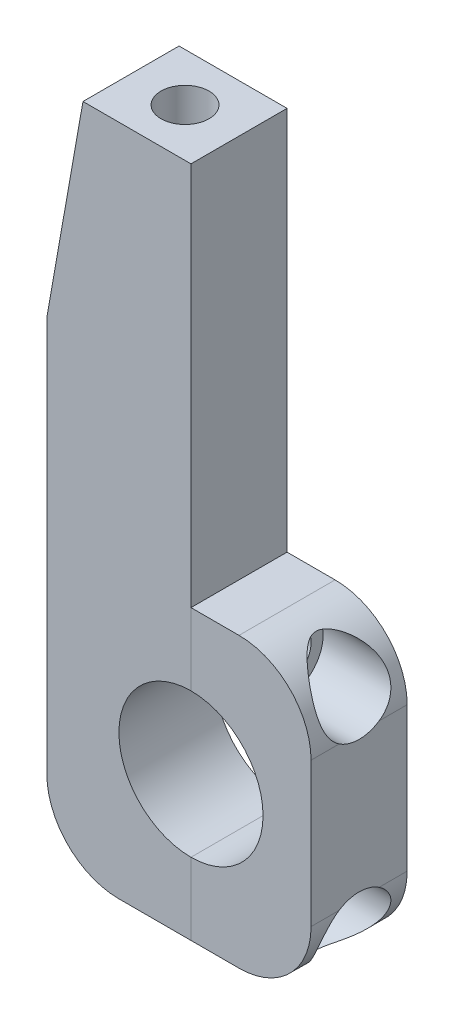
from build123d import *
from OCP.BRepFilletAPI import BRepFilletAPI_MakeChamfer

# Parameters (mm, degrees)
BOSS_EXTRUDE1_DEPTH     = 6.35
BOSS_EXTRUDE2_DEPTH     = 6.35
FILLET1_R               = 9.525
CUT_EXTRUDE1_DEPTH      = 25.4
CUT_EXTRUDE1_DEPTH_BACK = 17.4752
SKETCH5_R               = 3.175
CHAMFER1_SIZE           = 1.778
CHAMFER1_SIZE2          = 2.95908892
FILLET2_R               = 9.525
CUT_EXTRUDE2_START      = 6.35
SKETCH6_R               = 4.7625
CUT_EXTRUDE2_DEPTH      = 15.875


with BuildPart() as part:
    # Sketch2 → Boss-Extrude1 (new, symmetric)
    with BuildSketch(Plane.XY):
        with BuildLine():
            Line((0, 19.05), (0, 69.85))
            Line((0, 69.85), (-14.2748, 69.85))
            Line((-14.2748, 69.85), (-19.05, 42.768495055))
            Line((-19.05, 42.768495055), (-19.05, -19.05))
            Line((-19.05, -19.05), (0, -19.05))
            Line((0, -19.05), (0, -9.525))
            ThreePointArc((0, -9.525), (-9.525, 0), (0, 9.525))
            Line((0, 9.525), (0, 19.05))
        make_face()
    extrude(amount=BOSS_EXTRUDE1_DEPTH, both=True)


with BuildPart() as body_2:
    # Sketch3 → Boss-Extrude2 (new, symmetric)
    with BuildSketch(Plane.XY):
        with BuildLine():
            Line((0, 9.525), (0, 19.05))
            Line((0, 19.05), (15.875, 19.05))
            Line((15.875, 19.05), (15.875, -19.05))
            Line((15.875, -19.05), (0, -19.05))
            Line((0, -19.05), (0, -9.525))
            ThreePointArc((0, -9.525), (9.525, 0), (0, 9.525))
        make_face()
    extrude(amount=BOSS_EXTRUDE2_DEPTH, both=True)

    # Fillet1
    fillet1_edges = [body_2.edges().sort_by_distance(p)[0] for p in [
        (15.875, 19.05, 0),
        (15.875, -19.05, 0),
    ]]
    fillet(fillet1_edges, radius=FILLET1_R)


with BuildPart() as cut_extrude1_tool:
    # Sketch5 → Cut-Extrude1 (new, two sides: drawn at the far end of the back side and taken through both)
    with BuildSketch(Plane(origin=(0, 0, 0), x_dir=(0, 0, -1), z_dir=(1, 0, 0)).offset(-CUT_EXTRUDE1_DEPTH_BACK)):
        with Locations(Location((0, 13.4874, 0), (0, 0, 180))):
            Circle(SKETCH5_R)
        with Locations(Location((0, -13.4874, 0), (0, 0, 180))):
            Circle(SKETCH5_R)
    extrude(amount=CUT_EXTRUDE1_DEPTH + CUT_EXTRUDE1_DEPTH_BACK)


with BuildPart() as part_1:
    add(part.part)

    # Cut-Extrude1: cut by cut_extrude1_tool
    add(cut_extrude1_tool.part, mode=Mode.SUBTRACT)

    # Chamfer1: one chamfer whose edges measure the first distance from different faces: ONE call of the kernel's chamfer builder (chamfer() names one face for all edges)
    chamfer1_edges_1 = [part_1.edges().sort_by_distance(p)[0] for p in [
        (-17.4752, 13.4874, -3.175),
    ]]
    chamfer1_side_1 = [part_1.faces().sort_by_distance(p)[0] for p in [
        (-8.7376, 13.4874, -3.175),
    ]]
    chamfer1_edges_2 = [part_1.edges().sort_by_distance(p)[0] for p in [
        (-17.4752, -13.4874, -3.175),
    ]]
    chamfer1_side_2 = [part_1.faces().sort_by_distance(p)[0] for p in [
        (-8.7376, -13.4874, -3.175),
    ]]
    chamfer1 = BRepFilletAPI_MakeChamfer(part_1.part.solid().wrapped)
    for e in chamfer1_edges_1:
        chamfer1.Add(CHAMFER1_SIZE, CHAMFER1_SIZE2, e.wrapped, chamfer1_side_1[0].wrapped)  # the first distance lies on this face
    for e in chamfer1_edges_2:
        chamfer1.Add(CHAMFER1_SIZE, CHAMFER1_SIZE2, e.wrapped, chamfer1_side_2[0].wrapped)  # the first distance lies on this face
    add(Compound.cast(chamfer1.Shape()), mode=Mode.REPLACE)

    # Fillet2
    fillet2_edges = [part_1.edges().sort_by_distance(p)[0] for p in [
        (-19.05, -19.05, 0),
    ]]
    fillet(fillet2_edges, radius=FILLET2_R)

    # Sketch7 → 1_4 _0.25_ Diameter Hole1 (revolve, cut)
    with BuildSketch(Plane(origin=(-7.1374, 69.85, 0), x_dir=(0, 0, 1), z_dir=(1, 0, 0))):
        Polygon((0, 0), (0, 19.052732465), (3.175, 17.145), (3.175, 0), align=None)
    revolve(axis=Axis((-7.1374, 76.2, 0), (0, -1, 0)), mode=Mode.SUBTRACT)


with BuildPart() as body_2_1:
    add(body_2.part)

    # Cut-Extrude1: cut by cut_extrude1_tool
    add(cut_extrude1_tool.part, mode=Mode.SUBTRACT)

    # Sketch6 → Cut-Extrude2 (cut)
    with BuildSketch(Plane(origin=(0, 0, 0), x_dir=(0, 0, -1), z_dir=(1, 0, 0)).offset(CUT_EXTRUDE2_START)):
        with Locations(Location((0, 13.4874, 0), (0, 0, 236.304737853))):
            Circle(SKETCH6_R)
        with Locations(Location((0, -13.4874, 0), (0, 0, 123.695262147))):
            Circle(SKETCH6_R)
    extrude(amount=CUT_EXTRUDE2_DEPTH, mode=Mode.SUBTRACT)


solid = Compound([part_1.part, body_2_1.part])
